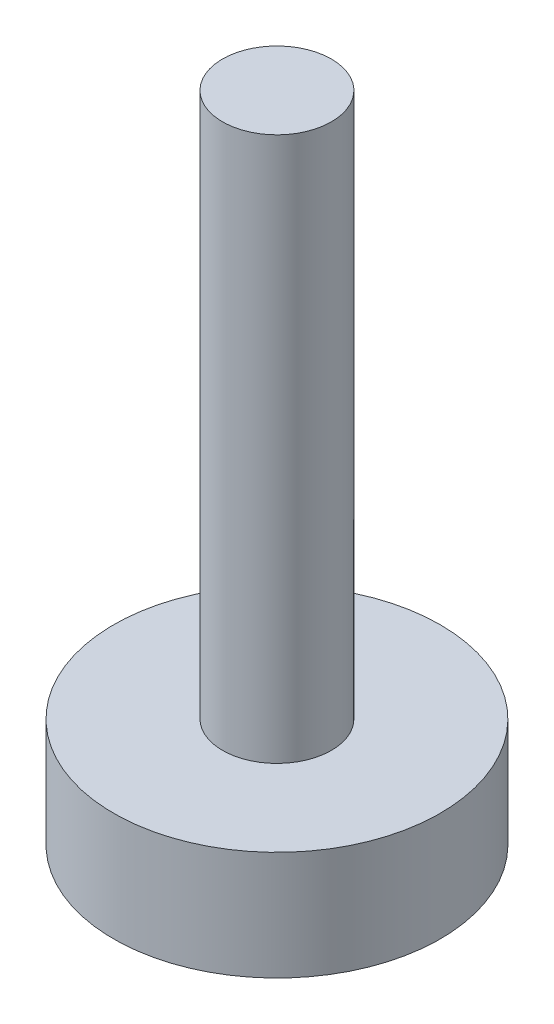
from build123d import *


with BuildPart() as part:
    # Sketch1 → Revolve1 (revolve)
    with BuildSketch(Plane.XY, mode=Mode.PRIVATE) as revolve1_sk:
        Polygon((0, 0), (19.05, 0), (19.05, 12.7), (6.35, 12.7), (6.35, 76.2), (0, 76.2), align=None)
    revolve(revolve1_sk.sketch.rotate(Axis((0, 0, 0), (0, 1, 0)), 90), axis=Axis((0, 0, 0), (0, 1, 0)))


solid = part.part
